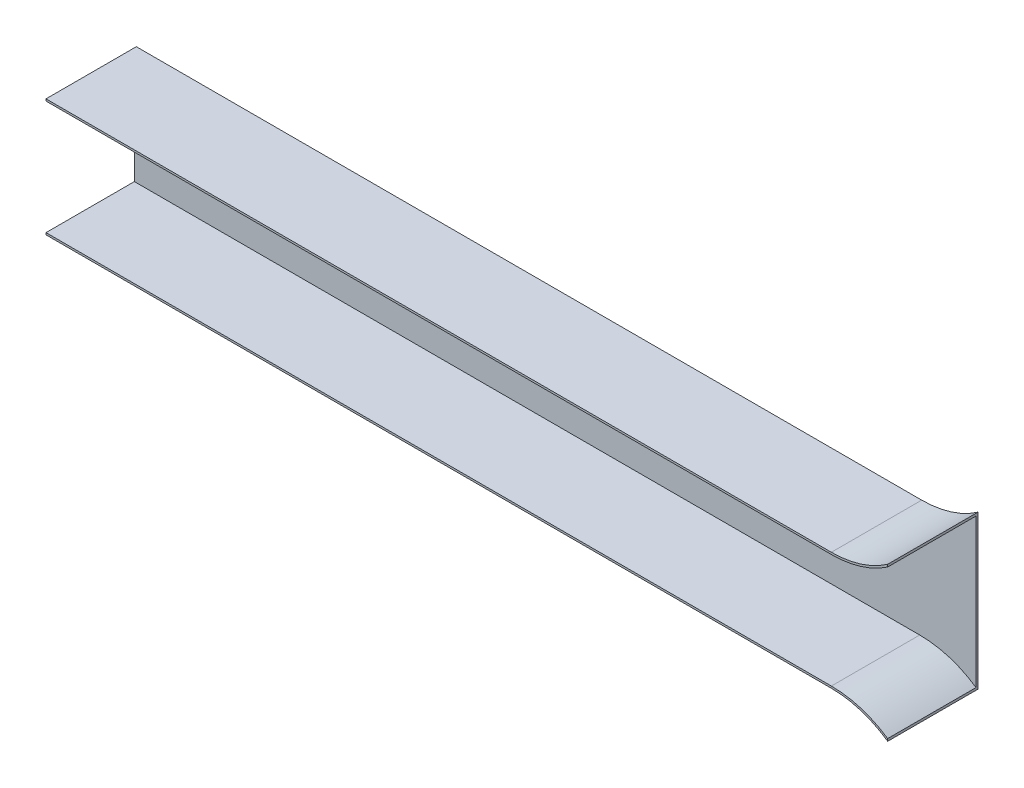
ISO-10303-21;
HEADER;
FILE_DESCRIPTION(('STEP AP214'),'2;1');
FILE_NAME('part.step','',(''),(''),'','','');
FILE_SCHEMA(('AUTOMOTIVE_DESIGN { 1 0 10303 214 1 1 1 1 }'));
ENDSEC;
DATA;
#1=APPLICATION_CONTEXT('core data for automotive mechanical design processes');
#2=APPLICATION_PROTOCOL_DEFINITION('international standard','automotive_design',2000,#1);
#3=PRODUCT_CONTEXT('',#1,'mechanical');
#4=PRODUCT('Part','Part','',(#3));
#5=PRODUCT_RELATED_PRODUCT_CATEGORY('part','',(#4));
#6=PRODUCT_DEFINITION_FORMATION('','',#4);
#7=PRODUCT_DEFINITION_CONTEXT('part definition',#1,'design');
#8=PRODUCT_DEFINITION('design','',#6,#7);
#9=PRODUCT_DEFINITION_SHAPE('','',#8);
#10=(LENGTH_UNIT() NAMED_UNIT(*) SI_UNIT(.MILLI.,.METRE.));
#11=(NAMED_UNIT(*) PLANE_ANGLE_UNIT() SI_UNIT($,.RADIAN.));
#12=(NAMED_UNIT(*) SI_UNIT($,.STERADIAN.) SOLID_ANGLE_UNIT());
#13=UNCERTAINTY_MEASURE_WITH_UNIT(LENGTH_MEASURE(1.E-05),#10,'distance_accuracy_value','');
#14=(GEOMETRIC_REPRESENTATION_CONTEXT(3) GLOBAL_UNCERTAINTY_ASSIGNED_CONTEXT((#13)) GLOBAL_UNIT_ASSIGNED_CONTEXT((#10,
#11,#12)) REPRESENTATION_CONTEXT('',''));
#15=CARTESIAN_POINT('',(0.,0.,0.));
#16=DIRECTION('',(0.,0.,1.));
#17=DIRECTION('',(1.,0.,0.));
#18=AXIS2_PLACEMENT_3D('',#15,#16,#17);
#19=CARTESIAN_POINT('',(400.,-80.,1.));
#20=DIRECTION('',(0.,0.,-1.));
#21=DIRECTION('',(-1.,0.,0.));
#22=AXIS2_PLACEMENT_3D('',#19,#20,#21);
#23=PLANE('',#22);
#24=CARTESIAN_POINT('',(400.,-80.,1.));
#25=DIRECTION('',(0.,0.,1.));
#26=DIRECTION('',(-1.,0.,0.));
#27=AXIS2_PLACEMENT_3D('',#24,#25,#26);
#28=CIRCLE('',#27,51.);
#29=CARTESIAN_POINT('',(428.678821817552,-37.8274357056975,1.));
#30=VERTEX_POINT('',#29);
#31=CARTESIAN_POINT('',(400.,-29.,1.));
#32=VERTEX_POINT('',#31);
#33=EDGE_CURVE('E46',#30,#32,#28,.T.);
#34=ORIENTED_EDGE('',*,*,#33,.F.);
#35=DIRECTION('',(0.,1.,0.));
#36=VECTOR('',#35,1.);
#37=CARTESIAN_POINT('',(428.678821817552,39.0423977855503,1.));
#38=LINE('',#37,#36);
#39=CARTESIAN_POINT('',(428.678821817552,37.8274357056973,1.));
#40=VERTEX_POINT('',#39);
#41=EDGE_CURVE('E28',#30,#40,#38,.T.);
#42=ORIENTED_EDGE('',*,*,#41,.T.);
#43=CARTESIAN_POINT('',(400.,80.,1.));
#44=DIRECTION('',(0.,0.,1.));
#45=DIRECTION('',(1.,0.,0.));
#46=AXIS2_PLACEMENT_3D('',#43,#44,#45);
#47=CIRCLE('',#46,51.);
#48=CARTESIAN_POINT('',(400.,29.,1.));
#49=VERTEX_POINT('',#48);
#50=EDGE_CURVE('E158',#49,#40,#47,.T.);
#51=ORIENTED_EDGE('',*,*,#50,.F.);
#52=DIRECTION('',(1.,0.,0.));
#53=VECTOR('',#52,1.);
#54=CARTESIAN_POINT('',(400.,29.,1.));
#55=LINE('',#54,#53);
#56=CARTESIAN_POINT('',(0.,29.,1.));
#57=VERTEX_POINT('',#56);
#58=EDGE_CURVE('E152',#57,#49,#55,.T.);
#59=ORIENTED_EDGE('',*,*,#58,.F.);
#60=DIRECTION('',(0.,-1.,0.));
#61=VECTOR('',#60,1.);
#62=CARTESIAN_POINT('',(0.,30.,1.));
#63=LINE('',#62,#61);
#64=CARTESIAN_POINT('',(0.,-28.9999999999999,1.));
#65=VERTEX_POINT('',#64);
#66=EDGE_CURVE('E201',#57,#65,#63,.T.);
#67=ORIENTED_EDGE('',*,*,#66,.T.);
#68=DIRECTION('',(-1.,0.,0.));
#69=VECTOR('',#68,1.);
#70=CARTESIAN_POINT('',(400.,-29.,1.));
#71=LINE('',#70,#69);
#72=EDGE_CURVE('E42',#32,#65,#71,.T.);
#73=ORIENTED_EDGE('',*,*,#72,.F.);
#74=EDGE_LOOP('',(#34,#42,#51,#59,#67,#73));
#75=FACE_BOUND('',#74,.T.);
#76=ADVANCED_FACE('F24',(#75),#23,.F.);
#77=CARTESIAN_POINT('',(400.,-80.,1.));
#78=DIRECTION('',(0.,0.,-1.));
#79=DIRECTION('',(-1.,0.,0.));
#80=AXIS2_PLACEMENT_3D('',#77,#78,#79);
#81=CYLINDRICAL_SURFACE('',#80,50.);
#82=CARTESIAN_POINT('',(400.,-80.,0.));
#83=DIRECTION('',(0.,0.,-1.));
#84=DIRECTION('',(-1.,0.,0.));
#85=AXIS2_PLACEMENT_3D('',#82,#83,#84);
#86=CIRCLE('',#85,50.);
#87=CARTESIAN_POINT('',(400.,-30.,0.));
#88=VERTEX_POINT('',#87);
#89=CARTESIAN_POINT('',(428.678821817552,-39.0423977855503,0.));
#90=VERTEX_POINT('',#89);
#91=EDGE_CURVE('E119',#88,#90,#86,.T.);
#92=ORIENTED_EDGE('',*,*,#91,.T.);
#93=DIRECTION('',(0.,0.,-1.));
#94=VECTOR('',#93,1.);
#95=CARTESIAN_POINT('',(428.678821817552,-39.0423977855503,1.));
#96=LINE('',#95,#94);
#97=CARTESIAN_POINT('',(428.678821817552,-39.0423977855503,46.));
#98=VERTEX_POINT('',#97);
#99=EDGE_CURVE('E11',#98,#90,#96,.T.);
#100=ORIENTED_EDGE('',*,*,#99,.F.);
#101=CARTESIAN_POINT('',(400.,-80.,46.));
#102=DIRECTION('',(0.,0.,-1.));
#103=DIRECTION('',(-1.,0.,0.));
#104=AXIS2_PLACEMENT_3D('',#101,#102,#103);
#105=CIRCLE('',#104,50.0000000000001);
#106=CARTESIAN_POINT('',(400.,-30.,46.));
#107=VERTEX_POINT('',#106);
#108=EDGE_CURVE('E117',#107,#98,#105,.T.);
#109=ORIENTED_EDGE('',*,*,#108,.F.);
#110=DIRECTION('',(0.,0.,-1.));
#111=VECTOR('',#110,1.);
#112=CARTESIAN_POINT('',(400.,-30.,1.));
#113=LINE('',#112,#111);
#114=EDGE_CURVE('E198',#107,#88,#113,.T.);
#115=ORIENTED_EDGE('',*,*,#114,.T.);
#116=EDGE_LOOP('',(#92,#100,#109,#115));
#117=FACE_BOUND('',#116,.T.);
#118=ADVANCED_FACE('F26',(#117),#81,.F.);
#119=CARTESIAN_POINT('',(428.678821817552,39.0423977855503,1.));
#120=DIRECTION('',(-1.,0.,0.));
#121=DIRECTION('',(0.,0.,1.));
#122=AXIS2_PLACEMENT_3D('',#119,#120,#121);
#123=PLANE('',#122);
#124=DIRECTION('',(0.,1.,0.));
#125=VECTOR('',#124,1.);
#126=CARTESIAN_POINT('',(428.678821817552,39.0423977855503,0.));
#127=LINE('',#126,#125);
#128=CARTESIAN_POINT('',(428.678821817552,39.0423977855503,0.));
#129=VERTEX_POINT('',#128);
#130=EDGE_CURVE('E185',#90,#129,#127,.T.);
#131=ORIENTED_EDGE('',*,*,#130,.T.);
#132=DIRECTION('',(0.,0.,-1.));
#133=VECTOR('',#132,1.);
#134=CARTESIAN_POINT('',(428.678821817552,39.0423977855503,1.));
#135=LINE('',#134,#133);
#136=CARTESIAN_POINT('',(428.678821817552,39.0423977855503,46.));
#137=VERTEX_POINT('',#136);
#138=EDGE_CURVE('E34',#137,#129,#135,.T.);
#139=ORIENTED_EDGE('',*,*,#138,.F.);
#140=DIRECTION('',(0.,1.,0.));
#141=VECTOR('',#140,1.);
#142=CARTESIAN_POINT('',(428.678821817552,37.8274357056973,46.));
#143=LINE('',#142,#141);
#144=CARTESIAN_POINT('',(428.678821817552,37.8274357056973,46.));
#145=VERTEX_POINT('',#144);
#146=EDGE_CURVE('E167',#145,#137,#143,.T.);
#147=ORIENTED_EDGE('',*,*,#146,.F.);
#148=DIRECTION('',(0.,0.,-1.));
#149=VECTOR('',#148,1.);
#150=CARTESIAN_POINT('',(428.678821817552,37.8274357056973,46.));
#151=LINE('',#150,#149);
#152=EDGE_CURVE('E164',#145,#40,#151,.T.);
#153=ORIENTED_EDGE('',*,*,#152,.T.);
#154=ORIENTED_EDGE('',*,*,#41,.F.);
#155=DIRECTION('',(0.,0.,-1.));
#156=VECTOR('',#155,1.);
#157=CARTESIAN_POINT('',(428.678821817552,-37.8274357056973,46.));
#158=LINE('',#157,#156);
#159=CARTESIAN_POINT('',(428.678821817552,-37.8274357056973,46.));
#160=VERTEX_POINT('',#159);
#161=EDGE_CURVE('E125',#160,#30,#158,.T.);
#162=ORIENTED_EDGE('',*,*,#161,.F.);
#163=DIRECTION('',(-1.82758465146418E-13,1.,0.));
#164=VECTOR('',#163,1.);
#165=CARTESIAN_POINT('',(428.678821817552,-37.8274357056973,46.));
#166=LINE('',#165,#164);
#167=EDGE_CURVE('E122',#98,#160,#166,.T.);
#168=ORIENTED_EDGE('',*,*,#167,.F.);
#169=ORIENTED_EDGE('',*,*,#99,.T.);
#170=EDGE_LOOP('',(#131,#139,#147,#153,#154,#162,#168,#169));
#171=FACE_BOUND('',#170,.T.);
#172=ADVANCED_FACE('F123',(#171),#123,.F.);
#173=CARTESIAN_POINT('',(400.,80.,1.));
#174=DIRECTION('',(0.,0.,-1.));
#175=DIRECTION('',(-1.,0.,0.));
#176=AXIS2_PLACEMENT_3D('',#173,#174,#175);
#177=CYLINDRICAL_SURFACE('',#176,50.);
#178=CARTESIAN_POINT('',(400.,80.,0.));
#179=DIRECTION('',(0.,0.,-1.));
#180=DIRECTION('',(1.,0.,0.));
#181=AXIS2_PLACEMENT_3D('',#178,#179,#180);
#182=CIRCLE('',#181,50.);
#183=CARTESIAN_POINT('',(400.,30.,0.));
#184=VERTEX_POINT('',#183);
#185=EDGE_CURVE('E187',#129,#184,#182,.T.);
#186=ORIENTED_EDGE('',*,*,#185,.T.);
#187=DIRECTION('',(0.,0.,-1.));
#188=VECTOR('',#187,1.);
#189=CARTESIAN_POINT('',(400.,30.,1.));
#190=LINE('',#189,#188);
#191=CARTESIAN_POINT('',(400.,30.,46.));
#192=VERTEX_POINT('',#191);
#193=EDGE_CURVE('E233',#192,#184,#190,.T.);
#194=ORIENTED_EDGE('',*,*,#193,.F.);
#195=CARTESIAN_POINT('',(400.,80.,46.));
#196=DIRECTION('',(0.,0.,-1.));
#197=DIRECTION('',(1.,0.,0.));
#198=AXIS2_PLACEMENT_3D('',#195,#196,#197);
#199=CIRCLE('',#198,50.);
#200=EDGE_CURVE('E155',#137,#192,#199,.T.);
#201=ORIENTED_EDGE('',*,*,#200,.F.);
#202=ORIENTED_EDGE('',*,*,#138,.T.);
#203=EDGE_LOOP('',(#186,#194,#201,#202));
#204=FACE_BOUND('',#203,.T.);
#205=ADVANCED_FACE('F240',(#204),#177,.F.);
#206=CARTESIAN_POINT('',(400.,30.,1.));
#207=DIRECTION('',(0.,-1.,0.));
#208=DIRECTION('',(1.,0.,0.));
#209=AXIS2_PLACEMENT_3D('',#206,#207,#208);
#210=PLANE('',#209);
#211=DIRECTION('',(-1.,0.,0.));
#212=VECTOR('',#211,1.);
#213=CARTESIAN_POINT('',(400.,30.,0.));
#214=LINE('',#213,#212);
#215=CARTESIAN_POINT('',(0.,30.,0.));
#216=VERTEX_POINT('',#215);
#217=EDGE_CURVE('E189',#184,#216,#214,.T.);
#218=ORIENTED_EDGE('',*,*,#217,.T.);
#219=DIRECTION('',(0.,0.,-1.));
#220=VECTOR('',#219,1.);
#221=CARTESIAN_POINT('',(0.,30.,1.));
#222=LINE('',#221,#220);
#223=CARTESIAN_POINT('',(0.,30.,46.));
#224=VERTEX_POINT('',#223);
#225=EDGE_CURVE('E232',#224,#216,#222,.T.);
#226=ORIENTED_EDGE('',*,*,#225,.F.);
#227=DIRECTION('',(-1.,0.,0.));
#228=VECTOR('',#227,1.);
#229=CARTESIAN_POINT('',(400.,30.,46.));
#230=LINE('',#229,#228);
#231=EDGE_CURVE('E249',#192,#224,#230,.T.);
#232=ORIENTED_EDGE('',*,*,#231,.F.);
#233=ORIENTED_EDGE('',*,*,#193,.T.);
#234=EDGE_LOOP('',(#218,#226,#232,#233));
#235=FACE_BOUND('',#234,.T.);
#236=ADVANCED_FACE('F246',(#235),#210,.F.);
#237=CARTESIAN_POINT('',(0.,30.,1.));
#238=DIRECTION('',(1.,0.,0.));
#239=DIRECTION('',(0.,0.,-1.));
#240=AXIS2_PLACEMENT_3D('',#237,#238,#239);
#241=PLANE('',#240);
#242=DIRECTION('',(0.,-1.,0.));
#243=VECTOR('',#242,1.);
#244=CARTESIAN_POINT('',(0.,30.,0.));
#245=LINE('',#244,#243);
#246=CARTESIAN_POINT('',(0.,-30.,0.));
#247=VERTEX_POINT('',#246);
#248=EDGE_CURVE('E191',#216,#247,#245,.T.);
#249=ORIENTED_EDGE('',*,*,#248,.T.);
#250=DIRECTION('',(0.,0.,-1.));
#251=VECTOR('',#250,1.);
#252=CARTESIAN_POINT('',(0.,-30.,1.));
#253=LINE('',#252,#251);
#254=CARTESIAN_POINT('',(0.,-30.,46.));
#255=VERTEX_POINT('',#254);
#256=EDGE_CURVE('E230',#255,#247,#253,.T.);
#257=ORIENTED_EDGE('',*,*,#256,.F.);
#258=DIRECTION('',(0.,-1.,0.));
#259=VECTOR('',#258,1.);
#260=CARTESIAN_POINT('',(0.,-30.,46.));
#261=LINE('',#260,#259);
#262=CARTESIAN_POINT('',(0.,-29.,46.));
#263=VERTEX_POINT('',#262);
#264=EDGE_CURVE('E142',#263,#255,#261,.T.);
#265=ORIENTED_EDGE('',*,*,#264,.F.);
#266=DIRECTION('',(0.,0.,-1.));
#267=VECTOR('',#266,1.);
#268=CARTESIAN_POINT('',(0.,-29.,46.));
#269=LINE('',#268,#267);
#270=EDGE_CURVE('E145',#263,#65,#269,.T.);
#271=ORIENTED_EDGE('',*,*,#270,.T.);
#272=ORIENTED_EDGE('',*,*,#66,.F.);
#273=DIRECTION('',(0.,0.,-1.));
#274=VECTOR('',#273,1.);
#275=CARTESIAN_POINT('',(0.,29.,46.));
#276=LINE('',#275,#274);
#277=CARTESIAN_POINT('',(0.,29.,46.));
#278=VERTEX_POINT('',#277);
#279=EDGE_CURVE('E172',#278,#57,#276,.T.);
#280=ORIENTED_EDGE('',*,*,#279,.F.);
#281=DIRECTION('',(0.,-1.,0.));
#282=VECTOR('',#281,1.);
#283=CARTESIAN_POINT('',(0.,30.,46.));
#284=LINE('',#283,#282);
#285=EDGE_CURVE('E218',#224,#278,#284,.T.);
#286=ORIENTED_EDGE('',*,*,#285,.F.);
#287=ORIENTED_EDGE('',*,*,#225,.T.);
#288=EDGE_LOOP('',(#249,#257,#265,#271,#272,#280,#286,#287));
#289=FACE_BOUND('',#288,.T.);
#290=ADVANCED_FACE('F216',(#289),#241,.F.);
#291=CARTESIAN_POINT('',(400.,-30.,1.));
#292=DIRECTION('',(0.,1.,0.));
#293=DIRECTION('',(-1.,0.,0.));
#294=AXIS2_PLACEMENT_3D('',#291,#292,#293);
#295=PLANE('',#294);
#296=DIRECTION('',(1.,0.,0.));
#297=VECTOR('',#296,1.);
#298=CARTESIAN_POINT('',(400.,-30.,0.));
#299=LINE('',#298,#297);
#300=EDGE_CURVE('E193',#247,#88,#299,.T.);
#301=ORIENTED_EDGE('',*,*,#300,.T.);
#302=ORIENTED_EDGE('',*,*,#114,.F.);
#303=DIRECTION('',(1.,0.,0.));
#304=VECTOR('',#303,1.);
#305=CARTESIAN_POINT('',(400.,-30.,46.));
#306=LINE('',#305,#304);
#307=EDGE_CURVE('E134',#255,#107,#306,.T.);
#308=ORIENTED_EDGE('',*,*,#307,.F.);
#309=ORIENTED_EDGE('',*,*,#256,.T.);
#310=EDGE_LOOP('',(#301,#302,#308,#309));
#311=FACE_BOUND('',#310,.T.);
#312=ADVANCED_FACE('F229',(#311),#295,.F.);
#313=CARTESIAN_POINT('',(400.,-80.,0.));
#314=DIRECTION('',(0.,0.,-1.));
#315=DIRECTION('',(-1.,0.,0.));
#316=AXIS2_PLACEMENT_3D('',#313,#314,#315);
#317=PLANE('',#316);
#318=ORIENTED_EDGE('',*,*,#91,.F.);
#319=ORIENTED_EDGE('',*,*,#300,.F.);
#320=ORIENTED_EDGE('',*,*,#248,.F.);
#321=ORIENTED_EDGE('',*,*,#217,.F.);
#322=ORIENTED_EDGE('',*,*,#185,.F.);
#323=ORIENTED_EDGE('',*,*,#130,.F.);
#324=EDGE_LOOP('',(#318,#319,#320,#321,#322,#323));
#325=FACE_BOUND('',#324,.T.);
#326=ADVANCED_FACE('F243',(#325),#317,.T.);
#327=CARTESIAN_POINT('',(400.,29.,46.));
#328=DIRECTION('',(0.,1.,0.));
#329=DIRECTION('',(-1.,0.,0.));
#330=AXIS2_PLACEMENT_3D('',#327,#328,#329);
#331=PLANE('',#330);
#332=ORIENTED_EDGE('',*,*,#58,.T.);
#333=DIRECTION('',(0.,0.,-1.));
#334=VECTOR('',#333,1.);
#335=CARTESIAN_POINT('',(400.,29.,46.));
#336=LINE('',#335,#334);
#337=CARTESIAN_POINT('',(400.,29.,46.));
#338=VERTEX_POINT('',#337);
#339=EDGE_CURVE('E166',#338,#49,#336,.T.);
#340=ORIENTED_EDGE('',*,*,#339,.F.);
#341=DIRECTION('',(1.,0.,0.));
#342=VECTOR('',#341,1.);
#343=CARTESIAN_POINT('',(400.,29.,46.));
#344=LINE('',#343,#342);
#345=EDGE_CURVE('E180',#278,#338,#344,.T.);
#346=ORIENTED_EDGE('',*,*,#345,.F.);
#347=ORIENTED_EDGE('',*,*,#279,.T.);
#348=EDGE_LOOP('',(#332,#340,#346,#347));
#349=FACE_BOUND('',#348,.T.);
#350=ADVANCED_FACE('F211',(#349),#331,.F.);
#351=CARTESIAN_POINT('',(400.,80.,46.));
#352=DIRECTION('',(0.,0.,-1.));
#353=DIRECTION('',(-1.,0.,0.));
#354=AXIS2_PLACEMENT_3D('',#351,#352,#353);
#355=CYLINDRICAL_SURFACE('',#354,51.);
#356=ORIENTED_EDGE('',*,*,#50,.T.);
#357=ORIENTED_EDGE('',*,*,#152,.F.);
#358=CARTESIAN_POINT('',(400.,80.,46.));
#359=DIRECTION('',(0.,0.,1.));
#360=DIRECTION('',(1.,0.,0.));
#361=AXIS2_PLACEMENT_3D('',#358,#359,#360);
#362=CIRCLE('',#361,51.);
#363=EDGE_CURVE('E175',#338,#145,#362,.T.);
#364=ORIENTED_EDGE('',*,*,#363,.F.);
#365=ORIENTED_EDGE('',*,*,#339,.T.);
#366=EDGE_LOOP('',(#356,#357,#364,#365));
#367=FACE_BOUND('',#366,.T.);
#368=ADVANCED_FACE('F252',(#367),#355,.T.);
#369=CARTESIAN_POINT('',(400.,80.,46.));
#370=DIRECTION('',(0.,0.,1.));
#371=DIRECTION('',(1.,0.,0.));
#372=AXIS2_PLACEMENT_3D('',#369,#370,#371);
#373=PLANE('',#372);
#374=ORIENTED_EDGE('',*,*,#200,.T.);
#375=ORIENTED_EDGE('',*,*,#231,.T.);
#376=ORIENTED_EDGE('',*,*,#285,.T.);
#377=ORIENTED_EDGE('',*,*,#345,.T.);
#378=ORIENTED_EDGE('',*,*,#363,.T.);
#379=ORIENTED_EDGE('',*,*,#146,.T.);
#380=EDGE_LOOP('',(#374,#375,#376,#377,#378,#379));
#381=FACE_BOUND('',#380,.T.);
#382=ADVANCED_FACE('F250',(#381),#373,.T.);
#383=CARTESIAN_POINT('',(400.,-80.,46.));
#384=DIRECTION('',(0.,0.,-1.));
#385=DIRECTION('',(-1.,0.,0.));
#386=AXIS2_PLACEMENT_3D('',#383,#384,#385);
#387=CYLINDRICAL_SURFACE('',#386,51.);
#388=ORIENTED_EDGE('',*,*,#33,.T.);
#389=DIRECTION('',(0.,0.,-1.));
#390=VECTOR('',#389,1.);
#391=CARTESIAN_POINT('',(400.,-29.,46.));
#392=LINE('',#391,#390);
#393=CARTESIAN_POINT('',(400.,-29.,46.));
#394=VERTEX_POINT('',#393);
#395=EDGE_CURVE('E148',#394,#32,#392,.T.);
#396=ORIENTED_EDGE('',*,*,#395,.F.);
#397=CARTESIAN_POINT('',(400.,-80.,46.));
#398=DIRECTION('',(0.,0.,1.));
#399=DIRECTION('',(-1.,0.,0.));
#400=AXIS2_PLACEMENT_3D('',#397,#398,#399);
#401=CIRCLE('',#400,51.);
#402=EDGE_CURVE('E128',#160,#394,#401,.T.);
#403=ORIENTED_EDGE('',*,*,#402,.F.);
#404=ORIENTED_EDGE('',*,*,#161,.T.);
#405=EDGE_LOOP('',(#388,#396,#403,#404));
#406=FACE_BOUND('',#405,.T.);
#407=ADVANCED_FACE('F226',(#406),#387,.T.);
#408=CARTESIAN_POINT('',(400.,-29.,46.));
#409=DIRECTION('',(0.,-1.,0.));
#410=DIRECTION('',(1.,0.,0.));
#411=AXIS2_PLACEMENT_3D('',#408,#409,#410);
#412=PLANE('',#411);
#413=ORIENTED_EDGE('',*,*,#72,.T.);
#414=ORIENTED_EDGE('',*,*,#270,.F.);
#415=DIRECTION('',(-1.,0.,0.));
#416=VECTOR('',#415,1.);
#417=CARTESIAN_POINT('',(400.,-29.,46.));
#418=LINE('',#417,#416);
#419=EDGE_CURVE('E140',#394,#263,#418,.T.);
#420=ORIENTED_EDGE('',*,*,#419,.F.);
#421=ORIENTED_EDGE('',*,*,#395,.T.);
#422=EDGE_LOOP('',(#413,#414,#420,#421));
#423=FACE_BOUND('',#422,.T.);
#424=ADVANCED_FACE('F222',(#423),#412,.F.);
#425=CARTESIAN_POINT('',(400.,-80.,46.));
#426=DIRECTION('',(0.,0.,-1.));
#427=DIRECTION('',(-1.,0.,0.));
#428=AXIS2_PLACEMENT_3D('',#425,#426,#427);
#429=PLANE('',#428);
#430=ORIENTED_EDGE('',*,*,#108,.T.);
#431=ORIENTED_EDGE('',*,*,#167,.T.);
#432=ORIENTED_EDGE('',*,*,#402,.T.);
#433=ORIENTED_EDGE('',*,*,#419,.T.);
#434=ORIENTED_EDGE('',*,*,#264,.T.);
#435=ORIENTED_EDGE('',*,*,#307,.T.);
#436=EDGE_LOOP('',(#430,#431,#432,#433,#434,#435));
#437=FACE_BOUND('',#436,.T.);
#438=ADVANCED_FACE('F131',(#437),#429,.F.);
#439=CLOSED_SHELL('',(#76,#118,#172,#205,#236,#290,#312,#326,#350,#368,#382,#407,#424,#438));
#440=MANIFOLD_SOLID_BREP('B2',#439);
#441=ADVANCED_BREP_SHAPE_REPRESENTATION('',(#18,#440),#14);
#442=SHAPE_DEFINITION_REPRESENTATION(#9,#441);
ENDSEC;
END-ISO-10303-21;
